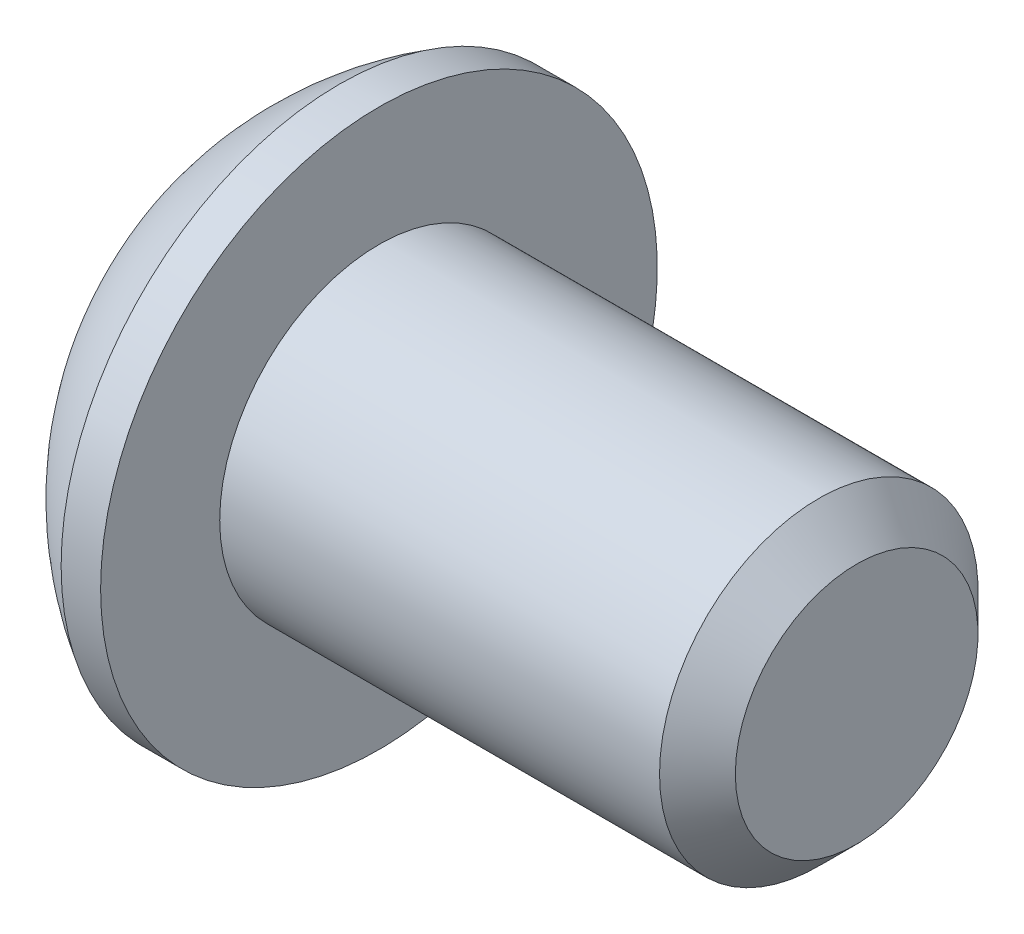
ISO-10303-21;
HEADER;
FILE_DESCRIPTION(('STEP AP214'),'2;1');
FILE_NAME('part.step','',(''),(''),'','','');
FILE_SCHEMA(('AUTOMOTIVE_DESIGN { 1 0 10303 214 1 1 1 1 }'));
ENDSEC;
DATA;
#1=APPLICATION_CONTEXT('core data for automotive mechanical design processes');
#2=APPLICATION_PROTOCOL_DEFINITION('international standard','automotive_design',2000,#1);
#3=PRODUCT_CONTEXT('',#1,'mechanical');
#4=PRODUCT('Part','Part','',(#3));
#5=PRODUCT_RELATED_PRODUCT_CATEGORY('part','',(#4));
#6=PRODUCT_DEFINITION_FORMATION('','',#4);
#7=PRODUCT_DEFINITION_CONTEXT('part definition',#1,'design');
#8=PRODUCT_DEFINITION('design','',#6,#7);
#9=PRODUCT_DEFINITION_SHAPE('','',#8);
#10=(LENGTH_UNIT() NAMED_UNIT(*) SI_UNIT(.MILLI.,.METRE.));
#11=(NAMED_UNIT(*) PLANE_ANGLE_UNIT() SI_UNIT($,.RADIAN.));
#12=(NAMED_UNIT(*) SI_UNIT($,.STERADIAN.) SOLID_ANGLE_UNIT());
#13=UNCERTAINTY_MEASURE_WITH_UNIT(LENGTH_MEASURE(1.E-05),#10,'distance_accuracy_value','');
#14=(GEOMETRIC_REPRESENTATION_CONTEXT(3) GLOBAL_UNCERTAINTY_ASSIGNED_CONTEXT((#13)) GLOBAL_UNIT_ASSIGNED_CONTEXT((#10,
#11,#12)) REPRESENTATION_CONTEXT('',''));
#15=CARTESIAN_POINT('',(0.,0.,0.));
#16=DIRECTION('',(0.,0.,1.));
#17=DIRECTION('',(1.,0.,0.));
#18=AXIS2_PLACEMENT_3D('',#15,#16,#17);
#19=CARTESIAN_POINT('',(0.,0.,0.));
#20=DIRECTION('',(-1.,0.,0.));
#21=DIRECTION('',(0.,0.,1.));
#22=AXIS2_PLACEMENT_3D('',#19,#20,#21);
#23=PLANE('',#22);
#24=CARTESIAN_POINT('',(0.,0.,0.));
#25=DIRECTION('',(-1.,0.,0.));
#26=DIRECTION('',(0.,0.,1.));
#27=AXIS2_PLACEMENT_3D('',#24,#25,#26);
#28=CIRCLE('',#27,2.77495);
#29=CARTESIAN_POINT('',(0.,2.77495,0.));
#30=VERTEX_POINT('',#29);
#31=EDGE_CURVE('E11',#30,#30,#28,.T.);
#32=ORIENTED_EDGE('',*,*,#31,.T.);
#33=EDGE_LOOP('',(#32));
#34=FACE_BOUND('',#33,.T.);
#35=DIRECTION('',(0.,-1.,0.));
#36=VECTOR('',#35,1.);
#37=CARTESIAN_POINT('',(0.,-1.14384635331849,1.9812));
#38=LINE('',#37,#36);
#39=CARTESIAN_POINT('',(0.,1.14384635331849,1.9812));
#40=VERTEX_POINT('',#39);
#41=CARTESIAN_POINT('',(0.,-1.14384635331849,1.9812));
#42=VERTEX_POINT('',#41);
#43=EDGE_CURVE('E55',#40,#42,#38,.T.);
#44=ORIENTED_EDGE('',*,*,#43,.T.);
#45=DIRECTION('',(0.,-0.5,-0.866025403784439));
#46=VECTOR('',#45,1.);
#47=CARTESIAN_POINT('',(0.,-2.28769270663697,0.));
#48=LINE('',#47,#46);
#49=CARTESIAN_POINT('',(0.,-2.28769270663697,0.));
#50=VERTEX_POINT('',#49);
#51=EDGE_CURVE('E427',#42,#50,#48,.T.);
#52=ORIENTED_EDGE('',*,*,#51,.T.);
#53=DIRECTION('',(0.,0.5,-0.866025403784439));
#54=VECTOR('',#53,1.);
#55=CARTESIAN_POINT('',(0.,-1.14384635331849,-1.9812));
#56=LINE('',#55,#54);
#57=CARTESIAN_POINT('',(0.,-1.14384635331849,-1.9812));
#58=VERTEX_POINT('',#57);
#59=EDGE_CURVE('E140',#50,#58,#56,.T.);
#60=ORIENTED_EDGE('',*,*,#59,.T.);
#61=DIRECTION('',(0.,1.,0.));
#62=VECTOR('',#61,1.);
#63=CARTESIAN_POINT('',(0.,1.14384635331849,-1.9812));
#64=LINE('',#63,#62);
#65=CARTESIAN_POINT('',(0.,1.14384635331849,-1.9812));
#66=VERTEX_POINT('',#65);
#67=EDGE_CURVE('E430',#58,#66,#64,.T.);
#68=ORIENTED_EDGE('',*,*,#67,.T.);
#69=DIRECTION('',(0.,0.5,0.866025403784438));
#70=VECTOR('',#69,1.);
#71=CARTESIAN_POINT('',(0.,2.28769270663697,0.));
#72=LINE('',#71,#70);
#73=CARTESIAN_POINT('',(0.,2.28769270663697,0.));
#74=VERTEX_POINT('',#73);
#75=EDGE_CURVE('E432',#66,#74,#72,.T.);
#76=ORIENTED_EDGE('',*,*,#75,.T.);
#77=DIRECTION('',(0.,-0.5,0.866025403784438));
#78=VECTOR('',#77,1.);
#79=CARTESIAN_POINT('',(0.,1.14384635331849,1.9812));
#80=LINE('',#79,#78);
#81=EDGE_CURVE('E434',#74,#40,#80,.T.);
#82=ORIENTED_EDGE('',*,*,#81,.T.);
#83=EDGE_LOOP('',(#44,#52,#60,#68,#76,#82));
#84=FACE_BOUND('',#83,.T.);
#85=ADVANCED_FACE('F41',(#34,#84),#23,.T.);
#86=CARTESIAN_POINT('',(5.78512506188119,0.,0.));
#87=DIRECTION('',(-1.,0.,0.));
#88=DIRECTION('',(0.,1.,0.));
#89=AXIS2_PLACEMENT_3D('',#86,#87,#88);
#90=SPHERICAL_SURFACE('',#89,6.41623094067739);
#91=CARTESIAN_POINT('',(2.5654,0.,0.));
#92=DIRECTION('',(-1.,0.,0.));
#93=DIRECTION('',(0.,0.,1.));
#94=AXIS2_PLACEMENT_3D('',#91,#92,#93);
#95=CIRCLE('',#94,5.5499);
#96=CARTESIAN_POINT('',(2.5654,5.5499,0.));
#97=VERTEX_POINT('',#96);
#98=EDGE_CURVE('E48',#97,#97,#95,.T.);
#99=CARTESIAN_POINT('',(2.5654,5.5499,0.));
#100=CARTESIAN_POINT('',(2.53083708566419,5.52984868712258,0.));
#101=CARTESIAN_POINT('',(2.49646152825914,5.50947442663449,0.));
#102=CARTESIAN_POINT('',(2.42809701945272,5.46808729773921,0.));
#103=CARTESIAN_POINT('',(2.39410806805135,5.44707442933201,0.));
#104=CARTESIAN_POINT('',(2.32652866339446,5.40441737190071,0.));
#105=CARTESIAN_POINT('',(2.29293821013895,5.38277318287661,0.));
#106=CARTESIAN_POINT('',(2.22616751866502,5.33886105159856,0.));
#107=CARTESIAN_POINT('',(2.19298728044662,5.3165931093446,0.));
#108=CARTESIAN_POINT('',(2.12704860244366,5.27144124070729,0.));
#109=CARTESIAN_POINT('',(2.09429016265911,5.24855731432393,0.));
#110=CARTESIAN_POINT('',(2.02920651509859,5.20218146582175,0.));
#111=CARTESIAN_POINT('',(1.99688130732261,5.17868954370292,0.));
#112=CARTESIAN_POINT('',(1.93267540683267,5.13110590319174,0.));
#113=CARTESIAN_POINT('',(1.90079471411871,5.10701418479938,0.));
#114=CARTESIAN_POINT('',(1.83748897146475,5.05823936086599,0.));
#115=CARTESIAN_POINT('',(1.80606392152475,5.03355625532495,0.));
#116=CARTESIAN_POINT('',(1.74368043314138,4.98360727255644,0.));
#117=CARTESIAN_POINT('',(1.71272199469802,4.95834139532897,0.));
#118=CARTESIAN_POINT('',(1.65128253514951,4.90723568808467,0.));
#119=CARTESIAN_POINT('',(1.62080151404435,4.88139585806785,0.));
#120=CARTESIAN_POINT('',(1.56032752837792,4.82915126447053,0.));
#121=CARTESIAN_POINT('',(1.53033456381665,4.80274650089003,0.));
#122=CARTESIAN_POINT('',(1.4708471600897,4.74938125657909,0.));
#123=CARTESIAN_POINT('',(1.44135272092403,4.72242077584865,0.));
#124=CARTESIAN_POINT('',(1.38287266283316,4.6679535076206,0.));
#125=CARTESIAN_POINT('',(1.35388704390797,4.64044672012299,0.));
#126=CARTESIAN_POINT('',(1.29643474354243,4.58489643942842,0.));
#127=CARTESIAN_POINT('',(1.26796806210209,4.55685294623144,0.));
#128=CARTESIAN_POINT('',(1.21156357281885,4.50023904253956,0.));
#129=CARTESIAN_POINT('',(1.18362576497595,4.47166863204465,0.));
#130=CARTESIAN_POINT('',(1.12828877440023,4.41401086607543,0.));
#131=CARTESIAN_POINT('',(1.10088959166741,4.38492351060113,0.));
#132=CARTESIAN_POINT('',(1.04663941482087,4.32624200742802,0.));
#133=CARTESIAN_POINT('',(1.01978842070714,4.2966478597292,0.));
#134=CARTESIAN_POINT('',(0.966643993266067,4.2369631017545,0.));
#135=CARTESIAN_POINT('',(0.940350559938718,4.20687249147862,0.));
#136=CARTESIAN_POINT('',(0.888330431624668,4.14620531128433,0.));
#137=CARTESIAN_POINT('',(0.862603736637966,4.11562874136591,0.));
#138=CARTESIAN_POINT('',(0.811726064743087,4.05400031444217,0.));
#139=CARTESIAN_POINT('',(0.786575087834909,4.02294845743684,0.));
#140=CARTESIAN_POINT('',(0.736857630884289,3.96038029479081,0.));
#141=CARTESIAN_POINT('',(0.712291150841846,3.9288639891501,0.));
#142=CARTESIAN_POINT('',(0.663751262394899,3.8653779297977,0.));
#143=CARTESIAN_POINT('',(0.639777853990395,3.833408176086,0.));
#144=CARTESIAN_POINT('',(0.592432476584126,3.76902637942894,0.));
#145=CARTESIAN_POINT('',(0.569060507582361,3.73661433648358,0.));
#146=CARTESIAN_POINT('',(0.522926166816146,3.67135927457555,0.));
#147=CARTESIAN_POINT('',(0.500163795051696,3.63851625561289,0.));
#148=CARTESIAN_POINT('',(0.455256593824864,3.57241070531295,0.));
#149=CARTESIAN_POINT('',(0.433111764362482,3.53914817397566,0.));
#150=CARTESIAN_POINT('',(0.389447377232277,3.47221520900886,0.));
#151=CARTESIAN_POINT('',(0.367927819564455,3.43854477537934,0.));
#152=CARTESIAN_POINT('',(0.325521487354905,3.37080775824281,0.));
#153=CARTESIAN_POINT('',(0.304634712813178,3.3367411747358,0.));
#154=CARTESIAN_POINT('',(0.263501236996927,3.26822374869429,0.));
#155=CARTESIAN_POINT('',(0.243254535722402,3.23377290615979,0.));
#156=CARTESIAN_POINT('',(0.203408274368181,3.16449898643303,0.));
#157=CARTESIAN_POINT('',(0.183808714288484,3.12967590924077,0.));
#158=CARTESIAN_POINT('',(0.145263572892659,3.05966967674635,0.));
#159=CARTESIAN_POINT('',(0.126317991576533,3.02448652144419,0.));
#160=CARTESIAN_POINT('',(0.0890874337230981,2.95377240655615,0.));
#161=CARTESIAN_POINT('',(0.0708024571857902,2.91824144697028,0.));
#162=CARTESIAN_POINT('',(0.0348994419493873,2.84684415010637,0.));
#163=CARTESIAN_POINT('',(0.0172814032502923,2.81097781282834,0.));
#164=CARTESIAN_POINT('',(0.,2.77495,0.));
#165=B_SPLINE_CURVE_WITH_KNOTS('',3,(#99,#100,#101,#102,#103,#104,#105,#106,#107,#108,#109,#110,
#111,#112,#113,#114,#115,#116,#117,#118,#119,#120,#121,#122,#123,#124,#125,#126,#127,#128,#129,
#130,#131,#132,#133,#134,#135,#136,#137,#138,#139,#140,#141,#142,#143,#144,#145,#146,#147,#148,
#149,#150,#151,#152,#153,#154,#155,#156,#157,#158,#159,#160,#161,#162,#163,#164),.UNSPECIFIED.,
.F.,.F.,(4,2,2,2,2,2,2,2,2,2,2,2,2,2,2,2,2,2,2,2,2,2,2,2,2,2,2,2,2,2,2,2,4),(0.,
0.119872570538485,0.239745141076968,0.359617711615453,0.479490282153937,0.599362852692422,
0.719235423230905,0.83910799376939,0.958980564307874,1.07885313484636,1.19872570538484,
1.31859827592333,1.43847084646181,1.55834341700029,1.67821598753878,1.79808855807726,
1.91796112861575,2.03783369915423,2.15770626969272,2.2775788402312,2.39745141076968,
2.51732398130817,2.63719655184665,2.75706912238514,2.87694169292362,2.99681426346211,
3.11668683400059,3.23655940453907,3.35643197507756,3.47630454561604,3.59617711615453,
3.71604968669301,3.8359222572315),.UNSPECIFIED.);
#166=EDGE_CURVE('BSEAM167',#97,#30,#165,.T.);
#167=ORIENTED_EDGE('',*,*,#98,.T.);
#168=ORIENTED_EDGE('',*,*,#31,.F.);
#169=ORIENTED_EDGE('',*,*,#166,.T.);
#170=ORIENTED_EDGE('',*,*,#166,.F.);
#171=EDGE_LOOP('',(#167,#169,#168,#170));
#172=FACE_BOUND('',#171,.T.);
#173=ADVANCED_FACE('F167',(#172),#90,.T.);
#174=CARTESIAN_POINT('',(0.,0.,0.));
#175=DIRECTION('',(-1.,0.,0.));
#176=DIRECTION('',(0.,0.,1.));
#177=AXIS2_PLACEMENT_3D('',#174,#175,#176);
#178=CYLINDRICAL_SURFACE('',#177,5.5499);
#179=ORIENTED_EDGE('',*,*,#98,.F.);
#180=EDGE_LOOP('',(#179));
#181=FACE_BOUND('',#180,.T.);
#182=CARTESIAN_POINT('',(3.3528,0.,0.));
#183=DIRECTION('',(-1.,0.,0.));
#184=DIRECTION('',(0.,0.,1.));
#185=AXIS2_PLACEMENT_3D('',#182,#183,#184);
#186=CIRCLE('',#185,5.5499);
#187=CARTESIAN_POINT('',(3.3528,0.,5.5499));
#188=VERTEX_POINT('',#187);
#189=EDGE_CURVE('E162',#188,#188,#186,.T.);
#190=ORIENTED_EDGE('',*,*,#189,.T.);
#191=EDGE_LOOP('',(#190));
#192=FACE_BOUND('',#191,.T.);
#193=ADVANCED_FACE('F170',(#181,#192),#178,.T.);
#194=CARTESIAN_POINT('',(3.3528,3.175,0.));
#195=DIRECTION('',(-1.,0.,0.));
#196=DIRECTION('',(0.,0.,1.));
#197=AXIS2_PLACEMENT_3D('',#194,#195,#196);
#198=PLANE('',#197);
#199=ORIENTED_EDGE('',*,*,#189,.F.);
#200=EDGE_LOOP('',(#199));
#201=FACE_BOUND('',#200,.T.);
#202=CARTESIAN_POINT('',(3.3528,0.,0.));
#203=DIRECTION('',(-1.,0.,0.));
#204=DIRECTION('',(0.,0.,1.));
#205=AXIS2_PLACEMENT_3D('',#202,#203,#204);
#206=CIRCLE('',#205,3.175);
#207=CARTESIAN_POINT('',(3.3528,0.,3.175));
#208=VERTEX_POINT('',#207);
#209=EDGE_CURVE('E159',#208,#208,#206,.T.);
#210=ORIENTED_EDGE('',*,*,#209,.T.);
#211=EDGE_LOOP('',(#210));
#212=FACE_BOUND('',#211,.T.);
#213=ADVANCED_FACE('F173',(#201,#212),#198,.F.);
#214=CARTESIAN_POINT('',(0.,0.,0.));
#215=DIRECTION('',(-1.,0.,0.));
#216=DIRECTION('',(0.,0.,1.));
#217=AXIS2_PLACEMENT_3D('',#214,#215,#216);
#218=CYLINDRICAL_SURFACE('',#217,3.175);
#219=ORIENTED_EDGE('',*,*,#209,.F.);
#220=EDGE_LOOP('',(#219));
#221=FACE_BOUND('',#220,.T.);
#222=CARTESIAN_POINT('',(12.12215,0.,0.));
#223=DIRECTION('',(-1.,0.,0.));
#224=DIRECTION('',(0.,0.,1.));
#225=AXIS2_PLACEMENT_3D('',#222,#223,#224);
#226=CIRCLE('',#225,3.175);
#227=CARTESIAN_POINT('',(12.12215,0.,3.175));
#228=VERTEX_POINT('',#227);
#229=EDGE_CURVE('E156',#228,#228,#226,.T.);
#230=ORIENTED_EDGE('',*,*,#229,.T.);
#231=EDGE_LOOP('',(#230));
#232=FACE_BOUND('',#231,.T.);
#233=ADVANCED_FACE('F179',(#221,#232),#218,.T.);
#234=CARTESIAN_POINT('',(12.8778,0.,0.));
#235=DIRECTION('',(-1.,0.,0.));
#236=DIRECTION('',(0.,0.,1.));
#237=AXIS2_PLACEMENT_3D('',#234,#235,#236);
#238=CONICAL_SURFACE('',#237,2.41935,0.78539816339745);
#239=ORIENTED_EDGE('',*,*,#229,.F.);
#240=EDGE_LOOP('',(#239));
#241=FACE_BOUND('',#240,.T.);
#242=CARTESIAN_POINT('',(12.8778,0.,0.));
#243=DIRECTION('',(-1.,0.,0.));
#244=DIRECTION('',(0.,0.,1.));
#245=AXIS2_PLACEMENT_3D('',#242,#243,#244);
#246=CIRCLE('',#245,2.41935);
#247=CARTESIAN_POINT('',(12.8778,0.,2.41935));
#248=VERTEX_POINT('',#247);
#249=EDGE_CURVE('E152',#248,#248,#246,.T.);
#250=ORIENTED_EDGE('',*,*,#249,.T.);
#251=EDGE_LOOP('',(#250));
#252=FACE_BOUND('',#251,.T.);
#253=ADVANCED_FACE('F185',(#241,#252),#238,.T.);
#254=CARTESIAN_POINT('',(12.8778,0.,0.));
#255=DIRECTION('',(-1.,0.,0.));
#256=DIRECTION('',(0.,0.,1.));
#257=AXIS2_PLACEMENT_3D('',#254,#255,#256);
#258=PLANE('',#257);
#259=ORIENTED_EDGE('',*,*,#249,.F.);
#260=EDGE_LOOP('',(#259));
#261=FACE_BOUND('',#260,.T.);
#262=ADVANCED_FACE('F191',(#261),#258,.F.);
#263=CARTESIAN_POINT('',(2.2098,-2.28769270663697,0.));
#264=DIRECTION('',(0.,0.866025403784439,-0.5));
#265=DIRECTION('',(0.,0.5,0.866025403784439));
#266=AXIS2_PLACEMENT_3D('',#263,#264,#265);
#267=PLANE('',#266);
#268=DIRECTION('',(0.,-0.5,-0.866025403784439));
#269=VECTOR('',#268,1.);
#270=CARTESIAN_POINT('',(2.2098,-2.28769270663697,0.));
#271=LINE('',#270,#269);
#272=CARTESIAN_POINT('',(2.2098,-1.14384635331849,1.9812));
#273=VERTEX_POINT('',#272);
#274=CARTESIAN_POINT('',(2.2098,-1.71576952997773,0.9906));
#275=VERTEX_POINT('',#274);
#276=EDGE_CURVE('E123',#273,#275,#271,.T.);
#277=ORIENTED_EDGE('',*,*,#276,.T.);
#278=CARTESIAN_POINT('',(2.2098,-2.28769270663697,0.));
#279=VERTEX_POINT('',#278);
#280=EDGE_CURVE('E116',#275,#279,#271,.T.);
#281=ORIENTED_EDGE('',*,*,#280,.T.);
#282=DIRECTION('',(-1.,0.,0.));
#283=VECTOR('',#282,1.);
#284=CARTESIAN_POINT('',(2.2098,-2.28769270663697,0.));
#285=LINE('',#284,#283);
#286=EDGE_CURVE('E120',#279,#50,#285,.T.);
#287=ORIENTED_EDGE('',*,*,#286,.T.);
#288=ORIENTED_EDGE('',*,*,#51,.F.);
#289=DIRECTION('',(-1.,0.,0.));
#290=VECTOR('',#289,1.);
#291=CARTESIAN_POINT('',(2.2098,-1.14384635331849,1.9812));
#292=LINE('',#291,#290);
#293=EDGE_CURVE('E426',#273,#42,#292,.T.);
#294=ORIENTED_EDGE('',*,*,#293,.F.);
#295=EDGE_LOOP('',(#277,#281,#287,#288,#294));
#296=FACE_BOUND('',#295,.T.);
#297=ADVANCED_FACE('F118',(#296),#267,.T.);
#298=CARTESIAN_POINT('',(2.2098,-1.14384635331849,-1.9812));
#299=DIRECTION('',(0.,0.866025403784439,0.5));
#300=DIRECTION('',(0.,-0.5,0.866025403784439));
#301=AXIS2_PLACEMENT_3D('',#298,#299,#300);
#302=PLANE('',#301);
#303=DIRECTION('',(0.,0.5,-0.866025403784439));
#304=VECTOR('',#303,1.);
#305=CARTESIAN_POINT('',(2.2098,-1.14384635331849,-1.9812));
#306=LINE('',#305,#304);
#307=CARTESIAN_POINT('',(2.2098,-1.71576952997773,-0.9906));
#308=VERTEX_POINT('',#307);
#309=EDGE_CURVE('E128',#279,#308,#306,.T.);
#310=ORIENTED_EDGE('',*,*,#309,.T.);
#311=CARTESIAN_POINT('',(2.2098,-1.14384635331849,-1.9812));
#312=VERTEX_POINT('',#311);
#313=EDGE_CURVE('E135',#308,#312,#306,.T.);
#314=ORIENTED_EDGE('',*,*,#313,.T.);
#315=DIRECTION('',(-1.,0.,0.));
#316=VECTOR('',#315,1.);
#317=CARTESIAN_POINT('',(2.2098,-1.14384635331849,-1.9812));
#318=LINE('',#317,#316);
#319=EDGE_CURVE('E142',#312,#58,#318,.T.);
#320=ORIENTED_EDGE('',*,*,#319,.T.);
#321=ORIENTED_EDGE('',*,*,#59,.F.);
#322=ORIENTED_EDGE('',*,*,#286,.F.);
#323=EDGE_LOOP('',(#310,#314,#320,#321,#322));
#324=FACE_BOUND('',#323,.T.);
#325=ADVANCED_FACE('F138',(#324),#302,.T.);
#326=CARTESIAN_POINT('',(2.2098,1.14384635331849,-1.9812));
#327=DIRECTION('',(0.,0.,1.));
#328=DIRECTION('',(1.,0.,0.));
#329=AXIS2_PLACEMENT_3D('',#326,#327,#328);
#330=PLANE('',#329);
#331=DIRECTION('',(0.,1.,0.));
#332=VECTOR('',#331,1.);
#333=CARTESIAN_POINT('',(2.2098,1.14384635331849,-1.9812));
#334=LINE('',#333,#332);
#335=CARTESIAN_POINT('',(2.2098,0.,-1.9812));
#336=VERTEX_POINT('',#335);
#337=EDGE_CURVE('E451',#312,#336,#334,.T.);
#338=ORIENTED_EDGE('',*,*,#337,.T.);
#339=CARTESIAN_POINT('',(2.2098,1.14384635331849,-1.9812));
#340=VERTEX_POINT('',#339);
#341=EDGE_CURVE('E134',#336,#340,#334,.T.);
#342=ORIENTED_EDGE('',*,*,#341,.T.);
#343=DIRECTION('',(-1.,0.,0.));
#344=VECTOR('',#343,1.);
#345=CARTESIAN_POINT('',(2.2098,1.14384635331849,-1.9812));
#346=LINE('',#345,#344);
#347=EDGE_CURVE('E147',#340,#66,#346,.T.);
#348=ORIENTED_EDGE('',*,*,#347,.T.);
#349=ORIENTED_EDGE('',*,*,#67,.F.);
#350=ORIENTED_EDGE('',*,*,#319,.F.);
#351=EDGE_LOOP('',(#338,#342,#348,#349,#350));
#352=FACE_BOUND('',#351,.T.);
#353=ADVANCED_FACE('F257',(#352),#330,.T.);
#354=CARTESIAN_POINT('',(2.2098,2.28769270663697,0.));
#355=DIRECTION('',(0.,-0.866025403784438,0.5));
#356=DIRECTION('',(0.,-0.5,-0.866025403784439));
#357=AXIS2_PLACEMENT_3D('',#354,#355,#356);
#358=PLANE('',#357);
#359=DIRECTION('',(0.,0.5,0.866025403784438));
#360=VECTOR('',#359,1.);
#361=CARTESIAN_POINT('',(2.2098,2.28769270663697,0.));
#362=LINE('',#361,#360);
#363=CARTESIAN_POINT('',(2.2098,1.71576952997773,-0.990600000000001));
#364=VERTEX_POINT('',#363);
#365=EDGE_CURVE('E413',#340,#364,#362,.T.);
#366=ORIENTED_EDGE('',*,*,#365,.T.);
#367=CARTESIAN_POINT('',(2.2098,2.28769270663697,0.));
#368=VERTEX_POINT('',#367);
#369=EDGE_CURVE('E453',#364,#368,#362,.T.);
#370=ORIENTED_EDGE('',*,*,#369,.T.);
#371=DIRECTION('',(-1.,0.,0.));
#372=VECTOR('',#371,1.);
#373=CARTESIAN_POINT('',(2.2098,2.28769270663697,0.));
#374=LINE('',#373,#372);
#375=EDGE_CURVE('E419',#368,#74,#374,.T.);
#376=ORIENTED_EDGE('',*,*,#375,.T.);
#377=ORIENTED_EDGE('',*,*,#75,.F.);
#378=ORIENTED_EDGE('',*,*,#347,.F.);
#379=EDGE_LOOP('',(#366,#370,#376,#377,#378));
#380=FACE_BOUND('',#379,.T.);
#381=ADVANCED_FACE('F267',(#380),#358,.T.);
#382=CARTESIAN_POINT('',(2.2098,1.14384635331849,1.9812));
#383=DIRECTION('',(0.,-0.866025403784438,-0.5));
#384=DIRECTION('',(0.,0.5,-0.866025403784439));
#385=AXIS2_PLACEMENT_3D('',#382,#383,#384);
#386=PLANE('',#385);
#387=DIRECTION('',(0.,-0.5,0.866025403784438));
#388=VECTOR('',#387,1.);
#389=CARTESIAN_POINT('',(2.2098,1.14384635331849,1.9812));
#390=LINE('',#389,#388);
#391=CARTESIAN_POINT('',(2.2098,1.71576952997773,0.990600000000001));
#392=VERTEX_POINT('',#391);
#393=EDGE_CURVE('E412',#368,#392,#390,.T.);
#394=ORIENTED_EDGE('',*,*,#393,.T.);
#395=CARTESIAN_POINT('',(2.2098,1.14384635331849,1.9812));
#396=VERTEX_POINT('',#395);
#397=EDGE_CURVE('E409',#392,#396,#390,.T.);
#398=ORIENTED_EDGE('',*,*,#397,.T.);
#399=DIRECTION('',(-1.,0.,0.));
#400=VECTOR('',#399,1.);
#401=CARTESIAN_POINT('',(2.2098,1.14384635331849,1.9812));
#402=LINE('',#401,#400);
#403=EDGE_CURVE('E439',#396,#40,#402,.T.);
#404=ORIENTED_EDGE('',*,*,#403,.T.);
#405=ORIENTED_EDGE('',*,*,#81,.F.);
#406=ORIENTED_EDGE('',*,*,#375,.F.);
#407=EDGE_LOOP('',(#394,#398,#404,#405,#406));
#408=FACE_BOUND('',#407,.T.);
#409=ADVANCED_FACE('F278',(#408),#386,.T.);
#410=CARTESIAN_POINT('',(2.2098,-1.14384635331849,1.9812));
#411=DIRECTION('',(0.,0.,-1.));
#412=DIRECTION('',(-1.,0.,0.));
#413=AXIS2_PLACEMENT_3D('',#410,#411,#412);
#414=PLANE('',#413);
#415=DIRECTION('',(0.,-1.,0.));
#416=VECTOR('',#415,1.);
#417=CARTESIAN_POINT('',(2.2098,-1.14384635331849,1.9812));
#418=LINE('',#417,#416);
#419=CARTESIAN_POINT('',(2.2098,0.,1.9812));
#420=VERTEX_POINT('',#419);
#421=EDGE_CURVE('E63',#396,#420,#418,.T.);
#422=ORIENTED_EDGE('',*,*,#421,.T.);
#423=EDGE_CURVE('E421',#420,#273,#418,.T.);
#424=ORIENTED_EDGE('',*,*,#423,.T.);
#425=ORIENTED_EDGE('',*,*,#293,.T.);
#426=ORIENTED_EDGE('',*,*,#43,.F.);
#427=ORIENTED_EDGE('',*,*,#403,.F.);
#428=EDGE_LOOP('',(#422,#424,#425,#426,#427));
#429=FACE_BOUND('',#428,.T.);
#430=ADVANCED_FACE('F289',(#429),#414,.T.);
#431=CARTESIAN_POINT('',(2.2098,0.,3.9624));
#432=DIRECTION('',(-1.,0.,0.));
#433=DIRECTION('',(0.,0.,1.));
#434=AXIS2_PLACEMENT_3D('',#431,#432,#433);
#435=PLANE('',#434);
#436=ORIENTED_EDGE('',*,*,#421,.F.);
#437=ORIENTED_EDGE('',*,*,#397,.F.);
#438=CARTESIAN_POINT('',(2.2098,0.,0.));
#439=DIRECTION('',(-1.,0.,0.));
#440=DIRECTION('',(0.,0.,1.));
#441=AXIS2_PLACEMENT_3D('',#438,#439,#440);
#442=CIRCLE('',#441,1.9812);
#443=EDGE_CURVE('E146',#420,#392,#442,.T.);
#444=ORIENTED_EDGE('',*,*,#443,.F.);
#445=EDGE_LOOP('',(#436,#437,#444));
#446=FACE_BOUND('',#445,.T.);
#447=ADVANCED_FACE('F300',(#446),#435,.T.);
#448=ORIENTED_EDGE('',*,*,#393,.F.);
#449=ORIENTED_EDGE('',*,*,#369,.F.);
#450=EDGE_CURVE('E153',#392,#364,#442,.T.);
#451=ORIENTED_EDGE('',*,*,#450,.F.);
#452=EDGE_LOOP('',(#448,#449,#451));
#453=FACE_BOUND('',#452,.T.);
#454=ADVANCED_FACE('F310',(#453),#435,.T.);
#455=ORIENTED_EDGE('',*,*,#365,.F.);
#456=ORIENTED_EDGE('',*,*,#341,.F.);
#457=EDGE_CURVE('E454',#364,#336,#442,.T.);
#458=ORIENTED_EDGE('',*,*,#457,.F.);
#459=EDGE_LOOP('',(#455,#456,#458));
#460=FACE_BOUND('',#459,.T.);
#461=ADVANCED_FACE('F322',(#460),#435,.T.);
#462=ORIENTED_EDGE('',*,*,#337,.F.);
#463=ORIENTED_EDGE('',*,*,#313,.F.);
#464=EDGE_CURVE('E452',#336,#308,#442,.T.);
#465=ORIENTED_EDGE('',*,*,#464,.F.);
#466=EDGE_LOOP('',(#462,#463,#465));
#467=FACE_BOUND('',#466,.T.);
#468=ADVANCED_FACE('F332',(#467),#435,.T.);
#469=ORIENTED_EDGE('',*,*,#309,.F.);
#470=ORIENTED_EDGE('',*,*,#280,.F.);
#471=EDGE_CURVE('E130',#308,#275,#442,.T.);
#472=ORIENTED_EDGE('',*,*,#471,.F.);
#473=EDGE_LOOP('',(#469,#470,#472));
#474=FACE_BOUND('',#473,.T.);
#475=ADVANCED_FACE('F129',(#474),#435,.T.);
#476=ORIENTED_EDGE('',*,*,#276,.F.);
#477=ORIENTED_EDGE('',*,*,#423,.F.);
#478=EDGE_CURVE('E141',#275,#420,#442,.T.);
#479=ORIENTED_EDGE('',*,*,#478,.F.);
#480=EDGE_LOOP('',(#476,#477,#479));
#481=FACE_BOUND('',#480,.T.);
#482=ADVANCED_FACE('F313',(#481),#435,.T.);
#483=CARTESIAN_POINT('',(3.3536463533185,0.,0.));
#484=DIRECTION('',(-1.,0.,0.));
#485=DIRECTION('',(0.,0.,1.));
#486=AXIS2_PLACEMENT_3D('',#483,#484,#485);
#487=CONICAL_SURFACE('',#486,0.,1.04719755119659);
#488=ORIENTED_EDGE('',*,*,#443,.T.);
#489=ORIENTED_EDGE('',*,*,#450,.T.);
#490=ORIENTED_EDGE('',*,*,#457,.T.);
#491=ORIENTED_EDGE('',*,*,#464,.T.);
#492=ORIENTED_EDGE('',*,*,#471,.T.);
#493=ORIENTED_EDGE('',*,*,#478,.T.);
#494=EDGE_LOOP('',(#488,#489,#490,#491,#492,#493));
#495=FACE_BOUND('',#494,.T.);
#496=CARTESIAN_POINT('',(3.3536463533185,0.,0.));
#497=VERTEX_POINT('',#496);
#498=VERTEX_LOOP('',#497);
#499=FACE_BOUND('',#498,.T.);
#500=ADVANCED_FACE('F359',(#495,#499),#487,.F.);
#501=CLOSED_SHELL('',(#85,#173,#193,#213,#233,#253,#262,#297,#325,#353,#381,#409,#430,#447,#454,
#461,#468,#475,#482,#500));
#502=MANIFOLD_SOLID_BREP('B2',#501);
#503=ADVANCED_BREP_SHAPE_REPRESENTATION('',(#18,#502),#14);
#504=SHAPE_DEFINITION_REPRESENTATION(#9,#503);
ENDSEC;
END-ISO-10303-21;
